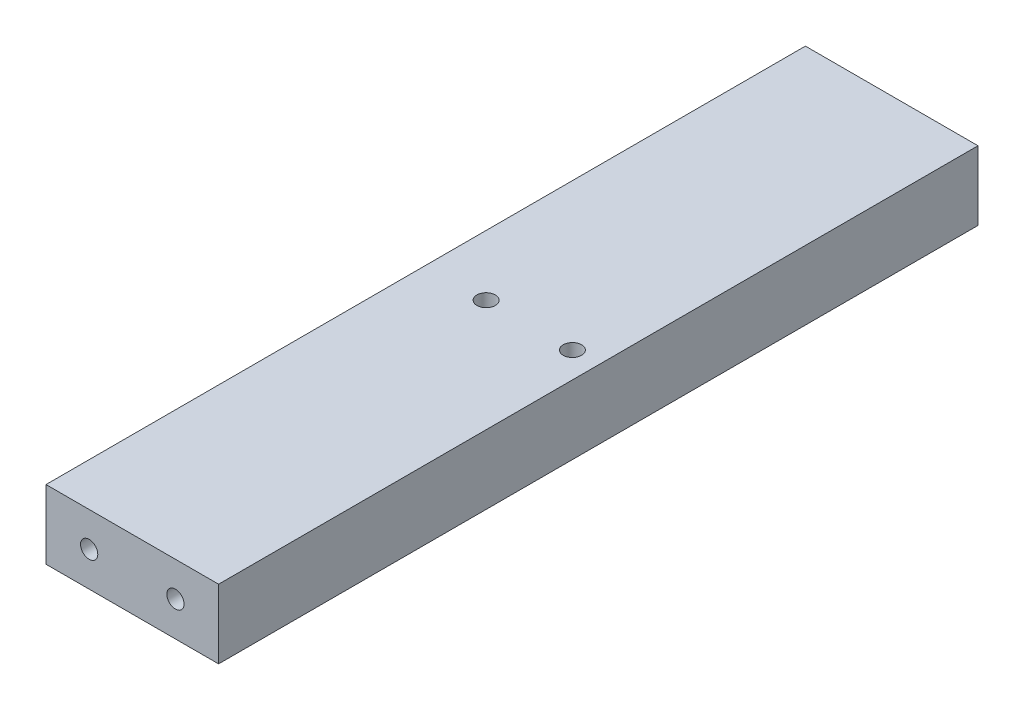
from build123d import *

# Parameters (mm, degrees)
SKETCH1_W                                           = 63.5
SKETCH1_H                                           = 279.4
BOSS_EXTRUDE1_DEPTH                                 = 12.7
F_1_4_0_25_DIAMETER_HOLE1_AT_2_COUNT                = 2
F_1_4_0_25_DIAMETER_HOLE1_AT_2_PITCH                = 31.75
SKETCH6_R                                           = 5
CUT_EXTRUDE1_DEPTH                                  = 19.05
CSK_FOR_1_4_FLAT_HEAD_MACHINE_SCREW_100_D           = 6.7564
CSK_FOR_1_4_FLAT_HEAD_MACHINE_SCREW_100_CSINK_D     = 12.8778
CSK_FOR_1_4_FLAT_HEAD_MACHINE_SCREW_100_CSINK_ANGLE = 100


with BuildPart() as part:
    # Sketch1 → Boss-Extrude1 (new, symmetric)
    with BuildSketch(Plane(origin=(0, 0, 0), x_dir=(1, 0, 0), z_dir=(0, 1, 0))):
        Rectangle(SKETCH1_W, SKETCH1_H)
    extrude(amount=BOSS_EXTRUDE1_DEPTH, both=True)

    # Sketch2 → 1_4 _0.25_ Diameter Hole1 (revolve, cut)
    with BuildSketch(Plane(origin=(15.875, 0, -139.7), x_dir=(0, 1, 0), z_dir=(1, 0, 0))):
        Polygon((0, 0), (0, 40.007732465), (3.175, 38.1), (3.175, 0), align=None)
    f_1_4_0_25_diameter_hole1 = revolve(axis=Axis((15.875, 0, -146.05), (0, 0, 1)), mode=Mode.SUBTRACT)

    # 1_4 _0.25_ Diameter Hole1 at 2: 1_4 _0.25_ Diameter Hole1 ×2
    with Locations(*[(-i * F_1_4_0_25_DIAMETER_HOLE1_AT_2_PITCH, 0, 0) for i in range(1, F_1_4_0_25_DIAMETER_HOLE1_AT_2_COUNT)]):
        add(f_1_4_0_25_diameter_hole1, mode=Mode.SUBTRACT)

    # Sketch6 → Cut-Extrude1 (cut)
    with BuildSketch(Plane.XZ.offset(12.7)):
        with Locations(Location((-15.875, -120.65, 0), (0, 0, 270))):
            Circle(SKETCH6_R)
        with Locations(Location((15.875, -120.65, 0), (0, 0, 270))):
            Circle(SKETCH6_R)
    cut_extrude1 = extrude(amount=-CUT_EXTRUDE1_DEPTH, mode=Mode.SUBTRACT)

    # Mirror1: 1_4 _0.25_ Diameter Hole1, Cut-Extrude1 across plane
    add(f_1_4_0_25_diameter_hole1.mirror(Plane.XY), mode=Mode.SUBTRACT)
    add(cut_extrude1.mirror(Plane.XY), mode=Mode.SUBTRACT)

    # Mirror1 copy 1 sketch → Mirror1 copy 1 (revolve, cut)
    with BuildSketch(Plane(origin=(-15.875, 0, 139.7), x_dir=(0, 1, 0), z_dir=(1, 0, 0))):
        Polygon((0, 0), (0, -40.007732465), (3.175, -38.1), (3.175, 0), align=None)
    revolve(axis=Axis((-15.875, 0, 146.05), (0, 0, 1)), mode=Mode.SUBTRACT)

    # CSK for 1_4 Flat Head Machine Screw _100 (through all)
    with Locations(Plane(origin=(0, -12.7, 0), x_dir=(-1, 0, 0), z_dir=(0, -1, 0))):
        with Locations((-22.225, 0), (9.525, 0)):
            CounterSinkHole(CSK_FOR_1_4_FLAT_HEAD_MACHINE_SCREW_100_D / 2, CSK_FOR_1_4_FLAT_HEAD_MACHINE_SCREW_100_CSINK_D / 2, counter_sink_angle=CSK_FOR_1_4_FLAT_HEAD_MACHINE_SCREW_100_CSINK_ANGLE)


solid = part.part
